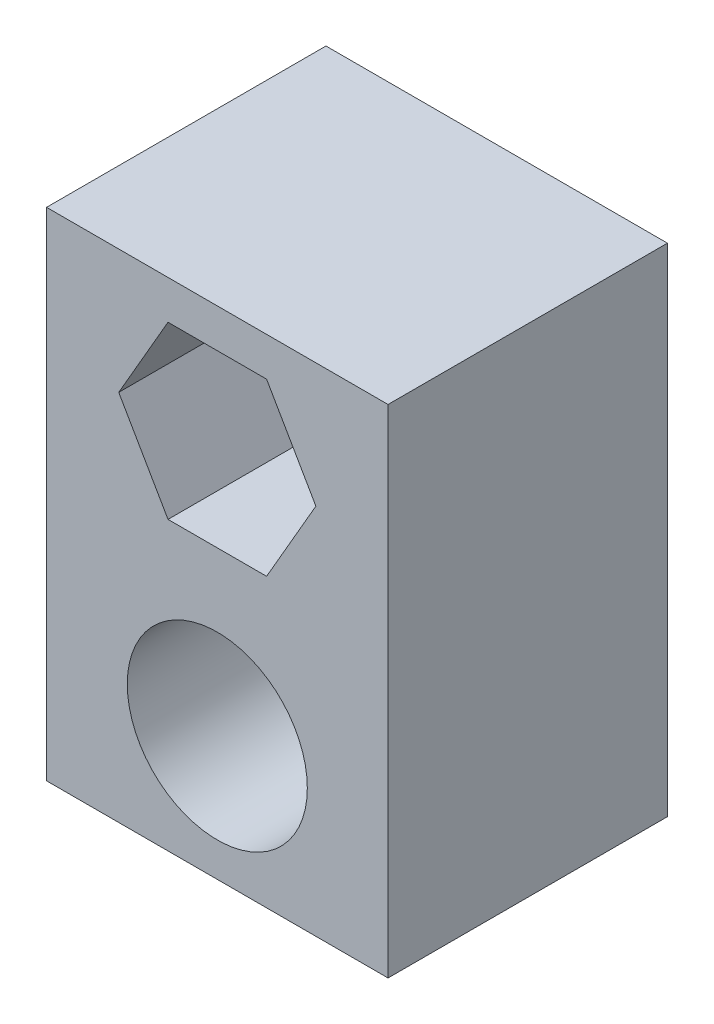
from build123d import *

# Parameters (mm, degrees)
SKETCH_1_W               = 11
SKETCH_1_H               = 16
EXTRUDE_1_DEPTH          = 9
SKETCH_2_R               = 2.9
CUT_EXTRUDE_1_DEPTH      = 5
CUT_EXTRUDE_2_DEPTH      = 21.049937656
CUT_EXTRUDE_2_DEPTH_BACK = 21.049937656
SKETCH_3_R               = 1.6


with BuildPart() as part:
    # Sketch 1 → Extrude 1 (new body)
    with BuildSketch(Plane.XY):
        with Locations((5.5, -8)):
            Rectangle(SKETCH_1_W, SKETCH_1_H)
    extrude(amount=EXTRUDE_1_DEPTH)

    # Sketch 2 → Cut-Extrude 1 (cut)
    with BuildSketch(Plane.XY.offset(9)):
        with Locations((5.5, -12)):
            Circle(SKETCH_2_R)
        Polygon((8.675426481, -4), (7.08771324, -1.25), (3.91228676, -1.25), (2.324573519, -4), (3.91228676, -6.75), (7.08771324, -6.75), align=None)
    extrude(amount=-CUT_EXTRUDE_1_DEPTH, mode=Mode.SUBTRACT)

    # Sketch 3 → Cut-Extrude 2 (cut, two sides: drawn at the far end of the back side and taken through both)
    with BuildSketch(Plane.XY.offset(4).offset(-CUT_EXTRUDE_2_DEPTH_BACK)):
        with Locations((5.5, -12)):
            Circle(SKETCH_3_R)
        with Locations((5.5, -4)):
            Circle(SKETCH_3_R)
    extrude(amount=CUT_EXTRUDE_2_DEPTH + CUT_EXTRUDE_2_DEPTH_BACK, mode=Mode.SUBTRACT)


solid = part.part
